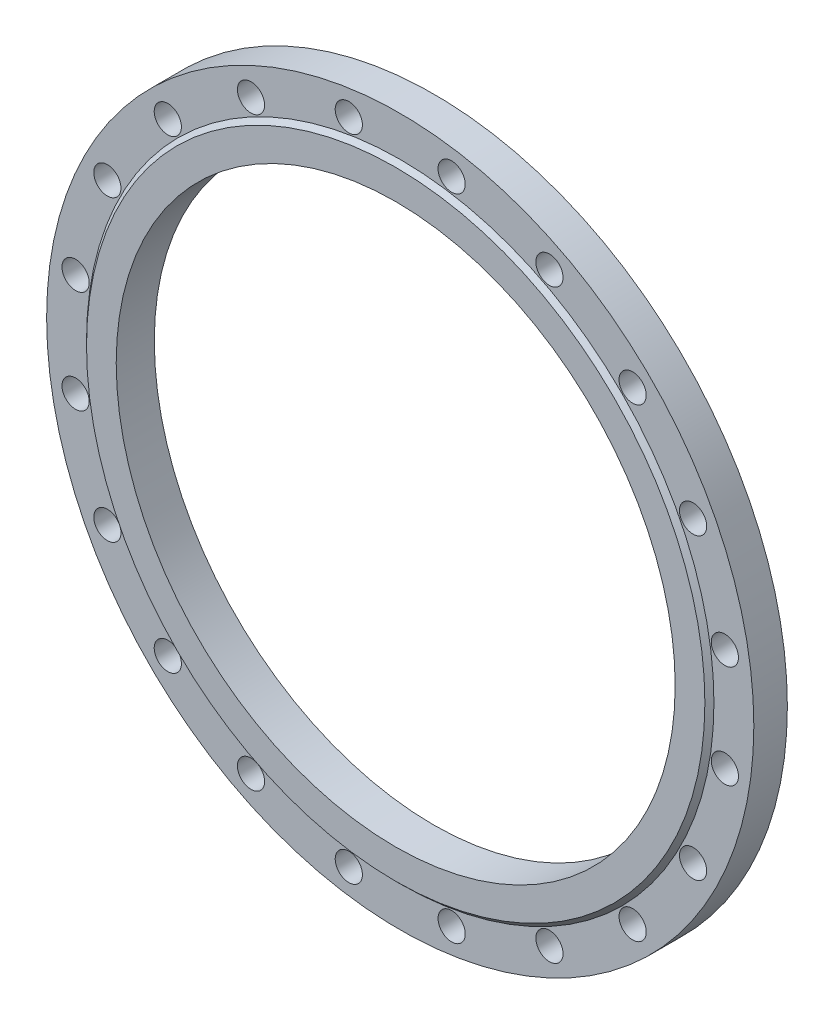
ISO-10303-21;
HEADER;
FILE_DESCRIPTION(('STEP AP214'),'2;1');
FILE_NAME('part.step','',(''),(''),'','','');
FILE_SCHEMA(('AUTOMOTIVE_DESIGN { 1 0 10303 214 1 1 1 1 }'));
ENDSEC;
DATA;
#1=APPLICATION_CONTEXT('core data for automotive mechanical design processes');
#2=APPLICATION_PROTOCOL_DEFINITION('international standard','automotive_design',2000,#1);
#3=PRODUCT_CONTEXT('',#1,'mechanical');
#4=PRODUCT('Part','Part','',(#3));
#5=PRODUCT_RELATED_PRODUCT_CATEGORY('part','',(#4));
#6=PRODUCT_DEFINITION_FORMATION('','',#4);
#7=PRODUCT_DEFINITION_CONTEXT('part definition',#1,'design');
#8=PRODUCT_DEFINITION('design','',#6,#7);
#9=PRODUCT_DEFINITION_SHAPE('','',#8);
#10=(LENGTH_UNIT() NAMED_UNIT(*) SI_UNIT(.MILLI.,.METRE.));
#11=(NAMED_UNIT(*) PLANE_ANGLE_UNIT() SI_UNIT($,.RADIAN.));
#12=(NAMED_UNIT(*) SI_UNIT($,.STERADIAN.) SOLID_ANGLE_UNIT());
#13=UNCERTAINTY_MEASURE_WITH_UNIT(LENGTH_MEASURE(1.E-05),#10,'distance_accuracy_value','');
#14=(GEOMETRIC_REPRESENTATION_CONTEXT(3) GLOBAL_UNCERTAINTY_ASSIGNED_CONTEXT((#13)) GLOBAL_UNIT_ASSIGNED_CONTEXT((#10,
#11,#12)) REPRESENTATION_CONTEXT('',''));
#15=CARTESIAN_POINT('',(0.,0.,0.));
#16=DIRECTION('',(0.,0.,1.));
#17=DIRECTION('',(1.,0.,0.));
#18=AXIS2_PLACEMENT_3D('',#15,#16,#17);
#19=CARTESIAN_POINT('',(0.,390.,-13.));
#20=DIRECTION('',(0.,0.,-1.));
#21=DIRECTION('',(-1.,0.,0.));
#22=AXIS2_PLACEMENT_3D('',#19,#20,#21);
#23=PLANE('',#22);
#24=CARTESIAN_POINT('',(322.989865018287,164.571556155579,-13.));
#25=DIRECTION('',(0.,0.,1.));
#26=DIRECTION('',(1.,0.,0.));
#27=AXIS2_PLACEMENT_3D('',#24,#25,#26);
#28=CIRCLE('',#27,15.0000000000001);
#29=CARTESIAN_POINT('',(337.989865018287,164.571556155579,-13.));
#30=VERTEX_POINT('',#29);
#31=EDGE_CURVE('E166',#30,#30,#28,.T.);
#32=ORIENTED_EDGE('',*,*,#31,.T.);
#33=EDGE_LOOP('',(#32));
#34=FACE_BOUND('',#33,.T.);
#35=CARTESIAN_POINT('',(256.326208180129,256.326208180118,-13.));
#36=DIRECTION('',(0.,0.,1.));
#37=DIRECTION('',(1.,0.,0.));
#38=AXIS2_PLACEMENT_3D('',#35,#36,#37);
#39=CIRCLE('',#38,15.);
#40=CARTESIAN_POINT('',(271.326208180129,256.326208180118,-13.));
#41=VERTEX_POINT('',#40);
#42=EDGE_CURVE('E160',#41,#41,#39,.T.);
#43=ORIENTED_EDGE('',*,*,#42,.T.);
#44=EDGE_LOOP('',(#43));
#45=FACE_BOUND('',#44,.T.);
#46=CARTESIAN_POINT('',(164.571556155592,322.98986501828,-13.));
#47=DIRECTION('',(0.,0.,1.));
#48=DIRECTION('',(1.,0.,0.));
#49=AXIS2_PLACEMENT_3D('',#46,#47,#48);
#50=CIRCLE('',#49,15.);
#51=CARTESIAN_POINT('',(179.571556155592,322.98986501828,-13.));
#52=VERTEX_POINT('',#51);
#53=EDGE_CURVE('E154',#52,#52,#50,.T.);
#54=ORIENTED_EDGE('',*,*,#53,.T.);
#55=EDGE_LOOP('',(#54));
#56=FACE_BOUND('',#55,.T.);
#57=CARTESIAN_POINT('',(56.7074935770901,358.037023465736,-13.));
#58=DIRECTION('',(0.,0.,1.));
#59=DIRECTION('',(1.,0.,0.));
#60=AXIS2_PLACEMENT_3D('',#57,#58,#59);
#61=CIRCLE('',#60,15.);
#62=CARTESIAN_POINT('',(71.7074935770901,358.037023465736,-13.));
#63=VERTEX_POINT('',#62);
#64=EDGE_CURVE('E148',#63,#63,#61,.T.);
#65=ORIENTED_EDGE('',*,*,#64,.T.);
#66=EDGE_LOOP('',(#65));
#67=FACE_BOUND('',#66,.T.);
#68=CARTESIAN_POINT('',(-56.7074935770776,358.037023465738,-13.));
#69=DIRECTION('',(0.,0.,1.));
#70=DIRECTION('',(1.,0.,0.));
#71=AXIS2_PLACEMENT_3D('',#68,#69,#70);
#72=CIRCLE('',#71,15.);
#73=CARTESIAN_POINT('',(-41.7074935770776,358.037023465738,-13.));
#74=VERTEX_POINT('',#73);
#75=EDGE_CURVE('E142',#74,#74,#72,.T.);
#76=ORIENTED_EDGE('',*,*,#75,.T.);
#77=EDGE_LOOP('',(#76));
#78=FACE_BOUND('',#77,.T.);
#79=CARTESIAN_POINT('',(-164.571556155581,322.989865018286,-13.));
#80=DIRECTION('',(0.,0.,1.));
#81=DIRECTION('',(1.,0.,0.));
#82=AXIS2_PLACEMENT_3D('',#79,#80,#81);
#83=CIRCLE('',#82,15.);
#84=CARTESIAN_POINT('',(-149.571556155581,322.989865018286,-13.));
#85=VERTEX_POINT('',#84);
#86=EDGE_CURVE('E136',#85,#85,#83,.T.);
#87=ORIENTED_EDGE('',*,*,#86,.T.);
#88=EDGE_LOOP('',(#87));
#89=FACE_BOUND('',#88,.T.);
#90=CARTESIAN_POINT('',(-256.326208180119,256.326208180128,-13.));
#91=DIRECTION('',(0.,0.,1.));
#92=DIRECTION('',(1.,0.,0.));
#93=AXIS2_PLACEMENT_3D('',#90,#91,#92);
#94=CIRCLE('',#93,15.);
#95=CARTESIAN_POINT('',(-241.326208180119,256.326208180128,-13.));
#96=VERTEX_POINT('',#95);
#97=EDGE_CURVE('E130',#96,#96,#94,.T.);
#98=ORIENTED_EDGE('',*,*,#97,.T.);
#99=EDGE_LOOP('',(#98));
#100=FACE_BOUND('',#99,.T.);
#101=CARTESIAN_POINT('',(-322.989865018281,164.571556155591,-13.));
#102=DIRECTION('',(0.,0.,1.));
#103=DIRECTION('',(1.,0.,0.));
#104=AXIS2_PLACEMENT_3D('',#101,#102,#103);
#105=CIRCLE('',#104,15.);
#106=CARTESIAN_POINT('',(-307.989865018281,164.571556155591,-13.));
#107=VERTEX_POINT('',#106);
#108=EDGE_CURVE('E124',#107,#107,#105,.T.);
#109=ORIENTED_EDGE('',*,*,#108,.T.);
#110=EDGE_LOOP('',(#109));
#111=FACE_BOUND('',#110,.T.);
#112=CARTESIAN_POINT('',(-358.037023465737,56.7074935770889,-13.));
#113=DIRECTION('',(0.,0.,1.));
#114=DIRECTION('',(1.,0.,0.));
#115=AXIS2_PLACEMENT_3D('',#112,#113,#114);
#116=CIRCLE('',#115,15.0000000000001);
#117=CARTESIAN_POINT('',(-343.037023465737,56.7074935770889,-13.));
#118=VERTEX_POINT('',#117);
#119=EDGE_CURVE('E118',#118,#118,#116,.T.);
#120=ORIENTED_EDGE('',*,*,#119,.T.);
#121=EDGE_LOOP('',(#120));
#122=FACE_BOUND('',#121,.T.);
#123=CARTESIAN_POINT('',(-358.037023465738,-56.7074935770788,-13.));
#124=DIRECTION('',(0.,0.,1.));
#125=DIRECTION('',(1.,0.,0.));
#126=AXIS2_PLACEMENT_3D('',#123,#124,#125);
#127=CIRCLE('',#126,15.);
#128=CARTESIAN_POINT('',(-343.037023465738,-56.7074935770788,-13.));
#129=VERTEX_POINT('',#128);
#130=EDGE_CURVE('E112',#129,#129,#127,.T.);
#131=ORIENTED_EDGE('',*,*,#130,.T.);
#132=EDGE_LOOP('',(#131));
#133=FACE_BOUND('',#132,.T.);
#134=CARTESIAN_POINT('',(-322.989865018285,-164.571556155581,-13.));
#135=DIRECTION('',(0.,0.,1.));
#136=DIRECTION('',(1.,0.,0.));
#137=AXIS2_PLACEMENT_3D('',#134,#135,#136);
#138=CIRCLE('',#137,15.);
#139=CARTESIAN_POINT('',(-307.989865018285,-164.571556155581,-13.));
#140=VERTEX_POINT('',#139);
#141=EDGE_CURVE('E106',#140,#140,#138,.T.);
#142=ORIENTED_EDGE('',*,*,#141,.T.);
#143=EDGE_LOOP('',(#142));
#144=FACE_BOUND('',#143,.T.);
#145=CARTESIAN_POINT('',(-256.326208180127,-256.32620818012,-13.));
#146=DIRECTION('',(0.,0.,1.));
#147=DIRECTION('',(1.,0.,0.));
#148=AXIS2_PLACEMENT_3D('',#145,#146,#147);
#149=CIRCLE('',#148,15.);
#150=CARTESIAN_POINT('',(-241.326208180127,-256.32620818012,-13.));
#151=VERTEX_POINT('',#150);
#152=EDGE_CURVE('E100',#151,#151,#149,.T.);
#153=ORIENTED_EDGE('',*,*,#152,.T.);
#154=EDGE_LOOP('',(#153));
#155=FACE_BOUND('',#154,.T.);
#156=CARTESIAN_POINT('',(-164.571556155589,-322.989865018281,-13.));
#157=DIRECTION('',(0.,0.,1.));
#158=DIRECTION('',(1.,0.,0.));
#159=AXIS2_PLACEMENT_3D('',#156,#157,#158);
#160=CIRCLE('',#159,15.);
#161=CARTESIAN_POINT('',(-149.571556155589,-322.989865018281,-13.));
#162=VERTEX_POINT('',#161);
#163=EDGE_CURVE('E94',#162,#162,#160,.T.);
#164=ORIENTED_EDGE('',*,*,#163,.T.);
#165=EDGE_LOOP('',(#164));
#166=FACE_BOUND('',#165,.T.);
#167=CARTESIAN_POINT('',(-56.7074935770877,-358.037023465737,-13.));
#168=DIRECTION('',(0.,0.,1.));
#169=DIRECTION('',(1.,0.,0.));
#170=AXIS2_PLACEMENT_3D('',#167,#168,#169);
#171=CIRCLE('',#170,15.);
#172=CARTESIAN_POINT('',(-41.7074935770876,-358.037023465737,-13.));
#173=VERTEX_POINT('',#172);
#174=EDGE_CURVE('E88',#173,#173,#171,.T.);
#175=ORIENTED_EDGE('',*,*,#174,.T.);
#176=EDGE_LOOP('',(#175));
#177=FACE_BOUND('',#176,.T.);
#178=CARTESIAN_POINT('',(56.7074935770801,-358.037023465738,-13.));
#179=DIRECTION('',(0.,0.,1.));
#180=DIRECTION('',(1.,0.,0.));
#181=AXIS2_PLACEMENT_3D('',#178,#179,#180);
#182=CIRCLE('',#181,15.);
#183=CARTESIAN_POINT('',(71.7074935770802,-358.037023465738,-13.));
#184=VERTEX_POINT('',#183);
#185=EDGE_CURVE('E82',#184,#184,#182,.T.);
#186=ORIENTED_EDGE('',*,*,#185,.T.);
#187=EDGE_LOOP('',(#186));
#188=FACE_BOUND('',#187,.T.);
#189=CARTESIAN_POINT('',(164.571556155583,-322.989865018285,-13.));
#190=DIRECTION('',(0.,0.,1.));
#191=DIRECTION('',(1.,0.,0.));
#192=AXIS2_PLACEMENT_3D('',#189,#190,#191);
#193=CIRCLE('',#192,15.);
#194=CARTESIAN_POINT('',(179.571556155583,-322.989865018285,-13.));
#195=VERTEX_POINT('',#194);
#196=EDGE_CURVE('E76',#195,#195,#193,.T.);
#197=ORIENTED_EDGE('',*,*,#196,.T.);
#198=EDGE_LOOP('',(#197));
#199=FACE_BOUND('',#198,.T.);
#200=CARTESIAN_POINT('',(256.326208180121,-256.326208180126,-13.));
#201=DIRECTION('',(0.,0.,1.));
#202=DIRECTION('',(1.,0.,0.));
#203=AXIS2_PLACEMENT_3D('',#200,#201,#202);
#204=CIRCLE('',#203,15.0000000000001);
#205=CARTESIAN_POINT('',(271.326208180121,-256.326208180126,-13.));
#206=VERTEX_POINT('',#205);
#207=EDGE_CURVE('E70',#206,#206,#204,.T.);
#208=ORIENTED_EDGE('',*,*,#207,.T.);
#209=EDGE_LOOP('',(#208));
#210=FACE_BOUND('',#209,.T.);
#211=CARTESIAN_POINT('',(322.989865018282,-164.571556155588,-13.));
#212=DIRECTION('',(0.,0.,1.));
#213=DIRECTION('',(1.,0.,0.));
#214=AXIS2_PLACEMENT_3D('',#211,#212,#213);
#215=CIRCLE('',#214,15.);
#216=CARTESIAN_POINT('',(337.989865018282,-164.571556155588,-13.));
#217=VERTEX_POINT('',#216);
#218=EDGE_CURVE('E64',#217,#217,#215,.T.);
#219=ORIENTED_EDGE('',*,*,#218,.T.);
#220=EDGE_LOOP('',(#219));
#221=FACE_BOUND('',#220,.T.);
#222=CARTESIAN_POINT('',(358.037023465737,-56.7074935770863,-13.));
#223=DIRECTION('',(0.,0.,1.));
#224=DIRECTION('',(1.,0.,0.));
#225=AXIS2_PLACEMENT_3D('',#222,#223,#224);
#226=CIRCLE('',#225,15.);
#227=CARTESIAN_POINT('',(373.037023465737,-56.7074935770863,-13.));
#228=VERTEX_POINT('',#227);
#229=EDGE_CURVE('E58',#228,#228,#226,.T.);
#230=ORIENTED_EDGE('',*,*,#229,.T.);
#231=EDGE_LOOP('',(#230));
#232=FACE_BOUND('',#231,.T.);
#233=CARTESIAN_POINT('',(358.037023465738,56.7074935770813,-13.));
#234=DIRECTION('',(0.,0.,1.));
#235=DIRECTION('',(1.,0.,0.));
#236=AXIS2_PLACEMENT_3D('',#233,#234,#235);
#237=CIRCLE('',#236,15.);
#238=CARTESIAN_POINT('',(373.037023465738,56.7074935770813,-13.));
#239=VERTEX_POINT('',#238);
#240=EDGE_CURVE('E54',#239,#239,#237,.T.);
#241=ORIENTED_EDGE('',*,*,#240,.T.);
#242=EDGE_LOOP('',(#241));
#243=FACE_BOUND('',#242,.T.);
#244=CARTESIAN_POINT('',(0.,0.,-13.));
#245=DIRECTION('',(0.,0.,-1.));
#246=DIRECTION('',(-1.,0.,0.));
#247=AXIS2_PLACEMENT_3D('',#244,#245,#246);
#248=CIRCLE('',#247,390.);
#249=CARTESIAN_POINT('',(-390.,0.,-13.));
#250=VERTEX_POINT('',#249);
#251=EDGE_CURVE('E10',#250,#250,#248,.T.);
#252=ORIENTED_EDGE('',*,*,#251,.T.);
#253=EDGE_LOOP('',(#252));
#254=FACE_BOUND('',#253,.T.);
#255=CARTESIAN_POINT('',(0.,0.,-13.));
#256=DIRECTION('',(0.,0.,-1.));
#257=DIRECTION('',(-1.,0.,0.));
#258=AXIS2_PLACEMENT_3D('',#255,#256,#257);
#259=CIRCLE('',#258,308.25);
#260=CARTESIAN_POINT('',(-308.25,0.,-13.));
#261=VERTEX_POINT('',#260);
#262=EDGE_CURVE('E51',#261,#261,#259,.T.);
#263=ORIENTED_EDGE('',*,*,#262,.F.);
#264=EDGE_LOOP('',(#263));
#265=FACE_BOUND('',#264,.T.);
#266=ADVANCED_FACE('F29',(#34,#45,#56,#67,#78,#89,#100,#111,#122,#133,#144,#155,#166,#177,#188,
#199,#210,#221,#232,#243,#254,#265),#23,.T.);
#267=CARTESIAN_POINT('',(0.,0.,0.));
#268=DIRECTION('',(0.,0.,-1.));
#269=DIRECTION('',(-1.,0.,0.));
#270=AXIS2_PLACEMENT_3D('',#267,#268,#269);
#271=CYLINDRICAL_SURFACE('',#270,390.);
#272=CARTESIAN_POINT('',(0.,0.,24.));
#273=DIRECTION('',(0.,0.,-1.));
#274=DIRECTION('',(-1.,0.,0.));
#275=AXIS2_PLACEMENT_3D('',#272,#273,#274);
#276=CIRCLE('',#275,390.);
#277=CARTESIAN_POINT('',(-390.,0.,24.));
#278=VERTEX_POINT('',#277);
#279=EDGE_CURVE('E35',#278,#278,#276,.T.);
#280=ORIENTED_EDGE('',*,*,#279,.T.);
#281=EDGE_LOOP('',(#280));
#282=FACE_BOUND('',#281,.T.);
#283=ORIENTED_EDGE('',*,*,#251,.F.);
#284=EDGE_LOOP('',(#283));
#285=FACE_BOUND('',#284,.T.);
#286=ADVANCED_FACE('F188',(#282,#285),#271,.T.);
#287=CARTESIAN_POINT('',(0.,346.,24.));
#288=DIRECTION('',(0.,0.,1.));
#289=DIRECTION('',(1.,0.,0.));
#290=AXIS2_PLACEMENT_3D('',#287,#288,#289);
#291=PLANE('',#290);
#292=CARTESIAN_POINT('',(322.989865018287,164.571556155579,24.));
#293=DIRECTION('',(0.,0.,1.));
#294=DIRECTION('',(1.,0.,0.));
#295=AXIS2_PLACEMENT_3D('',#292,#293,#294);
#296=CIRCLE('',#295,15.0000000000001);
#297=CARTESIAN_POINT('',(337.989865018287,164.571556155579,24.));
#298=VERTEX_POINT('',#297);
#299=EDGE_CURVE('E169',#298,#298,#296,.T.);
#300=ORIENTED_EDGE('',*,*,#299,.F.);
#301=EDGE_LOOP('',(#300));
#302=FACE_BOUND('',#301,.T.);
#303=CARTESIAN_POINT('',(256.326208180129,256.326208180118,24.));
#304=DIRECTION('',(0.,0.,1.));
#305=DIRECTION('',(1.,0.,0.));
#306=AXIS2_PLACEMENT_3D('',#303,#304,#305);
#307=CIRCLE('',#306,15.);
#308=CARTESIAN_POINT('',(271.326208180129,256.326208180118,24.));
#309=VERTEX_POINT('',#308);
#310=EDGE_CURVE('E163',#309,#309,#307,.T.);
#311=ORIENTED_EDGE('',*,*,#310,.F.);
#312=EDGE_LOOP('',(#311));
#313=FACE_BOUND('',#312,.T.);
#314=CARTESIAN_POINT('',(164.571556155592,322.98986501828,24.));
#315=DIRECTION('',(0.,0.,1.));
#316=DIRECTION('',(1.,0.,0.));
#317=AXIS2_PLACEMENT_3D('',#314,#315,#316);
#318=CIRCLE('',#317,15.);
#319=CARTESIAN_POINT('',(179.571556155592,322.98986501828,24.));
#320=VERTEX_POINT('',#319);
#321=EDGE_CURVE('E157',#320,#320,#318,.T.);
#322=ORIENTED_EDGE('',*,*,#321,.F.);
#323=EDGE_LOOP('',(#322));
#324=FACE_BOUND('',#323,.T.);
#325=CARTESIAN_POINT('',(56.7074935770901,358.037023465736,24.));
#326=DIRECTION('',(0.,0.,1.));
#327=DIRECTION('',(1.,0.,0.));
#328=AXIS2_PLACEMENT_3D('',#325,#326,#327);
#329=CIRCLE('',#328,15.);
#330=CARTESIAN_POINT('',(71.7074935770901,358.037023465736,24.));
#331=VERTEX_POINT('',#330);
#332=EDGE_CURVE('E151',#331,#331,#329,.T.);
#333=ORIENTED_EDGE('',*,*,#332,.F.);
#334=EDGE_LOOP('',(#333));
#335=FACE_BOUND('',#334,.T.);
#336=CARTESIAN_POINT('',(-56.7074935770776,358.037023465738,24.));
#337=DIRECTION('',(0.,0.,1.));
#338=DIRECTION('',(1.,0.,0.));
#339=AXIS2_PLACEMENT_3D('',#336,#337,#338);
#340=CIRCLE('',#339,15.);
#341=CARTESIAN_POINT('',(-41.7074935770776,358.037023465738,24.));
#342=VERTEX_POINT('',#341);
#343=EDGE_CURVE('E145',#342,#342,#340,.T.);
#344=ORIENTED_EDGE('',*,*,#343,.F.);
#345=EDGE_LOOP('',(#344));
#346=FACE_BOUND('',#345,.T.);
#347=CARTESIAN_POINT('',(-164.571556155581,322.989865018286,24.));
#348=DIRECTION('',(0.,0.,1.));
#349=DIRECTION('',(1.,0.,0.));
#350=AXIS2_PLACEMENT_3D('',#347,#348,#349);
#351=CIRCLE('',#350,15.);
#352=CARTESIAN_POINT('',(-149.571556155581,322.989865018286,24.));
#353=VERTEX_POINT('',#352);
#354=EDGE_CURVE('E139',#353,#353,#351,.T.);
#355=ORIENTED_EDGE('',*,*,#354,.F.);
#356=EDGE_LOOP('',(#355));
#357=FACE_BOUND('',#356,.T.);
#358=CARTESIAN_POINT('',(-256.326208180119,256.326208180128,24.));
#359=DIRECTION('',(0.,0.,1.));
#360=DIRECTION('',(1.,0.,0.));
#361=AXIS2_PLACEMENT_3D('',#358,#359,#360);
#362=CIRCLE('',#361,15.);
#363=CARTESIAN_POINT('',(-241.326208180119,256.326208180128,24.));
#364=VERTEX_POINT('',#363);
#365=EDGE_CURVE('E133',#364,#364,#362,.T.);
#366=ORIENTED_EDGE('',*,*,#365,.F.);
#367=EDGE_LOOP('',(#366));
#368=FACE_BOUND('',#367,.T.);
#369=CARTESIAN_POINT('',(-322.989865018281,164.571556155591,24.));
#370=DIRECTION('',(0.,0.,1.));
#371=DIRECTION('',(1.,0.,0.));
#372=AXIS2_PLACEMENT_3D('',#369,#370,#371);
#373=CIRCLE('',#372,15.);
#374=CARTESIAN_POINT('',(-307.989865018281,164.571556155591,24.));
#375=VERTEX_POINT('',#374);
#376=EDGE_CURVE('E127',#375,#375,#373,.T.);
#377=ORIENTED_EDGE('',*,*,#376,.F.);
#378=EDGE_LOOP('',(#377));
#379=FACE_BOUND('',#378,.T.);
#380=CARTESIAN_POINT('',(-358.037023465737,56.7074935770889,24.));
#381=DIRECTION('',(0.,0.,1.));
#382=DIRECTION('',(1.,0.,0.));
#383=AXIS2_PLACEMENT_3D('',#380,#381,#382);
#384=CIRCLE('',#383,15.0000000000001);
#385=CARTESIAN_POINT('',(-343.037023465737,56.7074935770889,24.));
#386=VERTEX_POINT('',#385);
#387=EDGE_CURVE('E121',#386,#386,#384,.T.);
#388=ORIENTED_EDGE('',*,*,#387,.F.);
#389=EDGE_LOOP('',(#388));
#390=FACE_BOUND('',#389,.T.);
#391=CARTESIAN_POINT('',(-358.037023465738,-56.7074935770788,24.));
#392=DIRECTION('',(0.,0.,1.));
#393=DIRECTION('',(1.,0.,0.));
#394=AXIS2_PLACEMENT_3D('',#391,#392,#393);
#395=CIRCLE('',#394,15.);
#396=CARTESIAN_POINT('',(-343.037023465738,-56.7074935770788,24.));
#397=VERTEX_POINT('',#396);
#398=EDGE_CURVE('E115',#397,#397,#395,.T.);
#399=ORIENTED_EDGE('',*,*,#398,.F.);
#400=EDGE_LOOP('',(#399));
#401=FACE_BOUND('',#400,.T.);
#402=CARTESIAN_POINT('',(-322.989865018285,-164.571556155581,24.));
#403=DIRECTION('',(0.,0.,1.));
#404=DIRECTION('',(1.,0.,0.));
#405=AXIS2_PLACEMENT_3D('',#402,#403,#404);
#406=CIRCLE('',#405,15.);
#407=CARTESIAN_POINT('',(-307.989865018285,-164.571556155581,24.));
#408=VERTEX_POINT('',#407);
#409=EDGE_CURVE('E109',#408,#408,#406,.T.);
#410=ORIENTED_EDGE('',*,*,#409,.F.);
#411=EDGE_LOOP('',(#410));
#412=FACE_BOUND('',#411,.T.);
#413=CARTESIAN_POINT('',(-256.326208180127,-256.32620818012,24.));
#414=DIRECTION('',(0.,0.,1.));
#415=DIRECTION('',(1.,0.,0.));
#416=AXIS2_PLACEMENT_3D('',#413,#414,#415);
#417=CIRCLE('',#416,15.);
#418=CARTESIAN_POINT('',(-241.326208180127,-256.32620818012,24.));
#419=VERTEX_POINT('',#418);
#420=EDGE_CURVE('E103',#419,#419,#417,.T.);
#421=ORIENTED_EDGE('',*,*,#420,.F.);
#422=EDGE_LOOP('',(#421));
#423=FACE_BOUND('',#422,.T.);
#424=CARTESIAN_POINT('',(-164.571556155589,-322.989865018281,24.));
#425=DIRECTION('',(0.,0.,1.));
#426=DIRECTION('',(1.,0.,0.));
#427=AXIS2_PLACEMENT_3D('',#424,#425,#426);
#428=CIRCLE('',#427,15.);
#429=CARTESIAN_POINT('',(-149.571556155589,-322.989865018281,24.));
#430=VERTEX_POINT('',#429);
#431=EDGE_CURVE('E97',#430,#430,#428,.T.);
#432=ORIENTED_EDGE('',*,*,#431,.F.);
#433=EDGE_LOOP('',(#432));
#434=FACE_BOUND('',#433,.T.);
#435=CARTESIAN_POINT('',(-56.7074935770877,-358.037023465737,24.));
#436=DIRECTION('',(0.,0.,1.));
#437=DIRECTION('',(1.,0.,0.));
#438=AXIS2_PLACEMENT_3D('',#435,#436,#437);
#439=CIRCLE('',#438,15.);
#440=CARTESIAN_POINT('',(-41.7074935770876,-358.037023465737,24.));
#441=VERTEX_POINT('',#440);
#442=EDGE_CURVE('E91',#441,#441,#439,.T.);
#443=ORIENTED_EDGE('',*,*,#442,.F.);
#444=EDGE_LOOP('',(#443));
#445=FACE_BOUND('',#444,.T.);
#446=CARTESIAN_POINT('',(56.7074935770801,-358.037023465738,24.));
#447=DIRECTION('',(0.,0.,1.));
#448=DIRECTION('',(1.,0.,0.));
#449=AXIS2_PLACEMENT_3D('',#446,#447,#448);
#450=CIRCLE('',#449,15.);
#451=CARTESIAN_POINT('',(71.7074935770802,-358.037023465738,24.));
#452=VERTEX_POINT('',#451);
#453=EDGE_CURVE('E85',#452,#452,#450,.T.);
#454=ORIENTED_EDGE('',*,*,#453,.F.);
#455=EDGE_LOOP('',(#454));
#456=FACE_BOUND('',#455,.T.);
#457=CARTESIAN_POINT('',(164.571556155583,-322.989865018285,24.));
#458=DIRECTION('',(0.,0.,1.));
#459=DIRECTION('',(1.,0.,0.));
#460=AXIS2_PLACEMENT_3D('',#457,#458,#459);
#461=CIRCLE('',#460,15.);
#462=CARTESIAN_POINT('',(179.571556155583,-322.989865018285,24.));
#463=VERTEX_POINT('',#462);
#464=EDGE_CURVE('E79',#463,#463,#461,.T.);
#465=ORIENTED_EDGE('',*,*,#464,.F.);
#466=EDGE_LOOP('',(#465));
#467=FACE_BOUND('',#466,.T.);
#468=CARTESIAN_POINT('',(256.326208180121,-256.326208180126,24.));
#469=DIRECTION('',(0.,0.,1.));
#470=DIRECTION('',(1.,0.,0.));
#471=AXIS2_PLACEMENT_3D('',#468,#469,#470);
#472=CIRCLE('',#471,15.0000000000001);
#473=CARTESIAN_POINT('',(271.326208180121,-256.326208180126,24.));
#474=VERTEX_POINT('',#473);
#475=EDGE_CURVE('E73',#474,#474,#472,.T.);
#476=ORIENTED_EDGE('',*,*,#475,.F.);
#477=EDGE_LOOP('',(#476));
#478=FACE_BOUND('',#477,.T.);
#479=CARTESIAN_POINT('',(322.989865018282,-164.571556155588,24.));
#480=DIRECTION('',(0.,0.,1.));
#481=DIRECTION('',(1.,0.,0.));
#482=AXIS2_PLACEMENT_3D('',#479,#480,#481);
#483=CIRCLE('',#482,15.);
#484=CARTESIAN_POINT('',(337.989865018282,-164.571556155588,24.));
#485=VERTEX_POINT('',#484);
#486=EDGE_CURVE('E67',#485,#485,#483,.T.);
#487=ORIENTED_EDGE('',*,*,#486,.F.);
#488=EDGE_LOOP('',(#487));
#489=FACE_BOUND('',#488,.T.);
#490=CARTESIAN_POINT('',(358.037023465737,-56.7074935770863,24.));
#491=DIRECTION('',(0.,0.,1.));
#492=DIRECTION('',(1.,0.,0.));
#493=AXIS2_PLACEMENT_3D('',#490,#491,#492);
#494=CIRCLE('',#493,15.);
#495=CARTESIAN_POINT('',(373.037023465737,-56.7074935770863,24.));
#496=VERTEX_POINT('',#495);
#497=EDGE_CURVE('E61',#496,#496,#494,.T.);
#498=ORIENTED_EDGE('',*,*,#497,.F.);
#499=EDGE_LOOP('',(#498));
#500=FACE_BOUND('',#499,.T.);
#501=CARTESIAN_POINT('',(358.037023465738,56.7074935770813,24.));
#502=DIRECTION('',(0.,0.,1.));
#503=DIRECTION('',(1.,0.,0.));
#504=AXIS2_PLACEMENT_3D('',#501,#502,#503);
#505=CIRCLE('',#504,15.);
#506=CARTESIAN_POINT('',(373.037023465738,56.7074935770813,24.));
#507=VERTEX_POINT('',#506);
#508=EDGE_CURVE('E55',#507,#507,#505,.T.);
#509=ORIENTED_EDGE('',*,*,#508,.F.);
#510=EDGE_LOOP('',(#509));
#511=FACE_BOUND('',#510,.T.);
#512=CARTESIAN_POINT('',(0.,0.,24.));
#513=DIRECTION('',(0.,0.,-1.));
#514=DIRECTION('',(-1.,0.,0.));
#515=AXIS2_PLACEMENT_3D('',#512,#513,#514);
#516=CIRCLE('',#515,346.);
#517=CARTESIAN_POINT('',(-346.,0.,24.));
#518=VERTEX_POINT('',#517);
#519=EDGE_CURVE('E39',#518,#518,#516,.T.);
#520=ORIENTED_EDGE('',*,*,#519,.T.);
#521=EDGE_LOOP('',(#520));
#522=FACE_BOUND('',#521,.T.);
#523=ORIENTED_EDGE('',*,*,#279,.F.);
#524=EDGE_LOOP('',(#523));
#525=FACE_BOUND('',#524,.T.);
#526=ADVANCED_FACE('F184',(#302,#313,#324,#335,#346,#357,#368,#379,#390,#401,#412,#423,#434,
#445,#456,#467,#478,#489,#500,#511,#522,#525),#291,.T.);
#527=CARTESIAN_POINT('',(0.,0.,24.));
#528=DIRECTION('',(0.,0.,-1.));
#529=DIRECTION('',(-1.,0.,0.));
#530=AXIS2_PLACEMENT_3D('',#527,#528,#529);
#531=CONICAL_SURFACE('',#530,346.,0.785398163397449);
#532=CARTESIAN_POINT('',(0.,0.,29.));
#533=DIRECTION('',(0.,0.,-1.));
#534=DIRECTION('',(-1.,0.,0.));
#535=AXIS2_PLACEMENT_3D('',#532,#533,#534);
#536=CIRCLE('',#535,341.);
#537=CARTESIAN_POINT('',(-341.,0.,29.));
#538=VERTEX_POINT('',#537);
#539=EDGE_CURVE('E43',#538,#538,#536,.T.);
#540=ORIENTED_EDGE('',*,*,#539,.T.);
#541=EDGE_LOOP('',(#540));
#542=FACE_BOUND('',#541,.T.);
#543=ORIENTED_EDGE('',*,*,#519,.F.);
#544=EDGE_LOOP('',(#543));
#545=FACE_BOUND('',#544,.T.);
#546=ADVANCED_FACE('F187',(#542,#545),#531,.T.);
#547=CARTESIAN_POINT('',(0.,341.,29.));
#548=DIRECTION('',(0.,0.,1.));
#549=DIRECTION('',(1.,0.,0.));
#550=AXIS2_PLACEMENT_3D('',#547,#548,#549);
#551=PLANE('',#550);
#552=CARTESIAN_POINT('',(0.,0.,29.));
#553=DIRECTION('',(0.,0.,-1.));
#554=DIRECTION('',(-1.,0.,0.));
#555=AXIS2_PLACEMENT_3D('',#552,#553,#554);
#556=CIRCLE('',#555,308.25);
#557=CARTESIAN_POINT('',(-308.25,0.,29.));
#558=VERTEX_POINT('',#557);
#559=EDGE_CURVE('E48',#558,#558,#556,.T.);
#560=ORIENTED_EDGE('',*,*,#559,.T.);
#561=EDGE_LOOP('',(#560));
#562=FACE_BOUND('',#561,.T.);
#563=ORIENTED_EDGE('',*,*,#539,.F.);
#564=EDGE_LOOP('',(#563));
#565=FACE_BOUND('',#564,.T.);
#566=ADVANCED_FACE('F232',(#562,#565),#551,.T.);
#567=CARTESIAN_POINT('',(0.,0.,0.));
#568=DIRECTION('',(0.,0.,-1.));
#569=DIRECTION('',(-1.,0.,0.));
#570=AXIS2_PLACEMENT_3D('',#567,#568,#569);
#571=CYLINDRICAL_SURFACE('',#570,308.25);
#572=ORIENTED_EDGE('',*,*,#262,.T.);
#573=EDGE_LOOP('',(#572));
#574=FACE_BOUND('',#573,.T.);
#575=ORIENTED_EDGE('',*,*,#559,.F.);
#576=EDGE_LOOP('',(#575));
#577=FACE_BOUND('',#576,.T.);
#578=ADVANCED_FACE('F238',(#574,#577),#571,.F.);
#579=CARTESIAN_POINT('',(358.037023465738,56.7074935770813,-13.));
#580=DIRECTION('',(0.,0.,1.));
#581=DIRECTION('',(1.,0.,0.));
#582=AXIS2_PLACEMENT_3D('',#579,#580,#581);
#583=CYLINDRICAL_SURFACE('',#582,15.);
#584=ORIENTED_EDGE('',*,*,#240,.F.);
#585=EDGE_LOOP('',(#584));
#586=FACE_BOUND('',#585,.T.);
#587=ORIENTED_EDGE('',*,*,#508,.T.);
#588=EDGE_LOOP('',(#587));
#589=FACE_BOUND('',#588,.T.);
#590=ADVANCED_FACE('F261',(#586,#589),#583,.F.);
#591=CARTESIAN_POINT('',(358.037023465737,-56.7074935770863,-13.));
#592=DIRECTION('',(0.,0.,1.));
#593=DIRECTION('',(1.,0.,0.));
#594=AXIS2_PLACEMENT_3D('',#591,#592,#593);
#595=CYLINDRICAL_SURFACE('',#594,15.);
#596=ORIENTED_EDGE('',*,*,#229,.F.);
#597=EDGE_LOOP('',(#596));
#598=FACE_BOUND('',#597,.T.);
#599=ORIENTED_EDGE('',*,*,#497,.T.);
#600=EDGE_LOOP('',(#599));
#601=FACE_BOUND('',#600,.T.);
#602=ADVANCED_FACE('F266',(#598,#601),#595,.F.);
#603=CARTESIAN_POINT('',(322.989865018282,-164.571556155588,-13.));
#604=DIRECTION('',(0.,0.,1.));
#605=DIRECTION('',(1.,0.,0.));
#606=AXIS2_PLACEMENT_3D('',#603,#604,#605);
#607=CYLINDRICAL_SURFACE('',#606,15.);
#608=ORIENTED_EDGE('',*,*,#218,.F.);
#609=EDGE_LOOP('',(#608));
#610=FACE_BOUND('',#609,.T.);
#611=ORIENTED_EDGE('',*,*,#486,.T.);
#612=EDGE_LOOP('',(#611));
#613=FACE_BOUND('',#612,.T.);
#614=ADVANCED_FACE('F278',(#610,#613),#607,.F.);
#615=CARTESIAN_POINT('',(256.326208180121,-256.326208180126,-13.));
#616=DIRECTION('',(0.,0.,1.));
#617=DIRECTION('',(1.,0.,0.));
#618=AXIS2_PLACEMENT_3D('',#615,#616,#617);
#619=CYLINDRICAL_SURFACE('',#618,15.0000000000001);
#620=ORIENTED_EDGE('',*,*,#207,.F.);
#621=EDGE_LOOP('',(#620));
#622=FACE_BOUND('',#621,.T.);
#623=ORIENTED_EDGE('',*,*,#475,.T.);
#624=EDGE_LOOP('',(#623));
#625=FACE_BOUND('',#624,.T.);
#626=ADVANCED_FACE('F288',(#622,#625),#619,.F.);
#627=CARTESIAN_POINT('',(164.571556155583,-322.989865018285,-13.));
#628=DIRECTION('',(0.,0.,1.));
#629=DIRECTION('',(1.,0.,0.));
#630=AXIS2_PLACEMENT_3D('',#627,#628,#629);
#631=CYLINDRICAL_SURFACE('',#630,15.);
#632=ORIENTED_EDGE('',*,*,#196,.F.);
#633=EDGE_LOOP('',(#632));
#634=FACE_BOUND('',#633,.T.);
#635=ORIENTED_EDGE('',*,*,#464,.T.);
#636=EDGE_LOOP('',(#635));
#637=FACE_BOUND('',#636,.T.);
#638=ADVANCED_FACE('F298',(#634,#637),#631,.F.);
#639=CARTESIAN_POINT('',(56.7074935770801,-358.037023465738,-13.));
#640=DIRECTION('',(0.,0.,1.));
#641=DIRECTION('',(1.,0.,0.));
#642=AXIS2_PLACEMENT_3D('',#639,#640,#641);
#643=CYLINDRICAL_SURFACE('',#642,15.);
#644=ORIENTED_EDGE('',*,*,#185,.F.);
#645=EDGE_LOOP('',(#644));
#646=FACE_BOUND('',#645,.T.);
#647=ORIENTED_EDGE('',*,*,#453,.T.);
#648=EDGE_LOOP('',(#647));
#649=FACE_BOUND('',#648,.T.);
#650=ADVANCED_FACE('F308',(#646,#649),#643,.F.);
#651=CARTESIAN_POINT('',(-56.7074935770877,-358.037023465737,-13.));
#652=DIRECTION('',(0.,0.,1.));
#653=DIRECTION('',(1.,0.,0.));
#654=AXIS2_PLACEMENT_3D('',#651,#652,#653);
#655=CYLINDRICAL_SURFACE('',#654,15.);
#656=ORIENTED_EDGE('',*,*,#174,.F.);
#657=EDGE_LOOP('',(#656));
#658=FACE_BOUND('',#657,.T.);
#659=ORIENTED_EDGE('',*,*,#442,.T.);
#660=EDGE_LOOP('',(#659));
#661=FACE_BOUND('',#660,.T.);
#662=ADVANCED_FACE('F318',(#658,#661),#655,.F.);
#663=CARTESIAN_POINT('',(-164.571556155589,-322.989865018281,-13.));
#664=DIRECTION('',(0.,0.,1.));
#665=DIRECTION('',(1.,0.,0.));
#666=AXIS2_PLACEMENT_3D('',#663,#664,#665);
#667=CYLINDRICAL_SURFACE('',#666,15.);
#668=ORIENTED_EDGE('',*,*,#163,.F.);
#669=EDGE_LOOP('',(#668));
#670=FACE_BOUND('',#669,.T.);
#671=ORIENTED_EDGE('',*,*,#431,.T.);
#672=EDGE_LOOP('',(#671));
#673=FACE_BOUND('',#672,.T.);
#674=ADVANCED_FACE('F328',(#670,#673),#667,.F.);
#675=CARTESIAN_POINT('',(-256.326208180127,-256.32620818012,-13.));
#676=DIRECTION('',(0.,0.,1.));
#677=DIRECTION('',(1.,0.,0.));
#678=AXIS2_PLACEMENT_3D('',#675,#676,#677);
#679=CYLINDRICAL_SURFACE('',#678,15.);
#680=ORIENTED_EDGE('',*,*,#152,.F.);
#681=EDGE_LOOP('',(#680));
#682=FACE_BOUND('',#681,.T.);
#683=ORIENTED_EDGE('',*,*,#420,.T.);
#684=EDGE_LOOP('',(#683));
#685=FACE_BOUND('',#684,.T.);
#686=ADVANCED_FACE('F338',(#682,#685),#679,.F.);
#687=CARTESIAN_POINT('',(-322.989865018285,-164.571556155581,-13.));
#688=DIRECTION('',(0.,0.,1.));
#689=DIRECTION('',(1.,0.,0.));
#690=AXIS2_PLACEMENT_3D('',#687,#688,#689);
#691=CYLINDRICAL_SURFACE('',#690,15.);
#692=ORIENTED_EDGE('',*,*,#141,.F.);
#693=EDGE_LOOP('',(#692));
#694=FACE_BOUND('',#693,.T.);
#695=ORIENTED_EDGE('',*,*,#409,.T.);
#696=EDGE_LOOP('',(#695));
#697=FACE_BOUND('',#696,.T.);
#698=ADVANCED_FACE('F348',(#694,#697),#691,.F.);
#699=CARTESIAN_POINT('',(-358.037023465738,-56.7074935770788,-13.));
#700=DIRECTION('',(0.,0.,1.));
#701=DIRECTION('',(1.,0.,0.));
#702=AXIS2_PLACEMENT_3D('',#699,#700,#701);
#703=CYLINDRICAL_SURFACE('',#702,15.);
#704=ORIENTED_EDGE('',*,*,#130,.F.);
#705=EDGE_LOOP('',(#704));
#706=FACE_BOUND('',#705,.T.);
#707=ORIENTED_EDGE('',*,*,#398,.T.);
#708=EDGE_LOOP('',(#707));
#709=FACE_BOUND('',#708,.T.);
#710=ADVANCED_FACE('F358',(#706,#709),#703,.F.);
#711=CARTESIAN_POINT('',(-358.037023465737,56.7074935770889,-13.));
#712=DIRECTION('',(0.,0.,1.));
#713=DIRECTION('',(1.,0.,0.));
#714=AXIS2_PLACEMENT_3D('',#711,#712,#713);
#715=CYLINDRICAL_SURFACE('',#714,15.0000000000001);
#716=ORIENTED_EDGE('',*,*,#119,.F.);
#717=EDGE_LOOP('',(#716));
#718=FACE_BOUND('',#717,.T.);
#719=ORIENTED_EDGE('',*,*,#387,.T.);
#720=EDGE_LOOP('',(#719));
#721=FACE_BOUND('',#720,.T.);
#722=ADVANCED_FACE('F368',(#718,#721),#715,.F.);
#723=CARTESIAN_POINT('',(-322.989865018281,164.571556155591,-13.));
#724=DIRECTION('',(0.,0.,1.));
#725=DIRECTION('',(1.,0.,0.));
#726=AXIS2_PLACEMENT_3D('',#723,#724,#725);
#727=CYLINDRICAL_SURFACE('',#726,15.);
#728=ORIENTED_EDGE('',*,*,#108,.F.);
#729=EDGE_LOOP('',(#728));
#730=FACE_BOUND('',#729,.T.);
#731=ORIENTED_EDGE('',*,*,#376,.T.);
#732=EDGE_LOOP('',(#731));
#733=FACE_BOUND('',#732,.T.);
#734=ADVANCED_FACE('F378',(#730,#733),#727,.F.);
#735=CARTESIAN_POINT('',(-256.326208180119,256.326208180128,-13.));
#736=DIRECTION('',(0.,0.,1.));
#737=DIRECTION('',(1.,0.,0.));
#738=AXIS2_PLACEMENT_3D('',#735,#736,#737);
#739=CYLINDRICAL_SURFACE('',#738,15.);
#740=ORIENTED_EDGE('',*,*,#97,.F.);
#741=EDGE_LOOP('',(#740));
#742=FACE_BOUND('',#741,.T.);
#743=ORIENTED_EDGE('',*,*,#365,.T.);
#744=EDGE_LOOP('',(#743));
#745=FACE_BOUND('',#744,.T.);
#746=ADVANCED_FACE('F388',(#742,#745),#739,.F.);
#747=CARTESIAN_POINT('',(-164.571556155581,322.989865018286,-13.));
#748=DIRECTION('',(0.,0.,1.));
#749=DIRECTION('',(1.,0.,0.));
#750=AXIS2_PLACEMENT_3D('',#747,#748,#749);
#751=CYLINDRICAL_SURFACE('',#750,15.);
#752=ORIENTED_EDGE('',*,*,#86,.F.);
#753=EDGE_LOOP('',(#752));
#754=FACE_BOUND('',#753,.T.);
#755=ORIENTED_EDGE('',*,*,#354,.T.);
#756=EDGE_LOOP('',(#755));
#757=FACE_BOUND('',#756,.T.);
#758=ADVANCED_FACE('F398',(#754,#757),#751,.F.);
#759=CARTESIAN_POINT('',(-56.7074935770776,358.037023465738,-13.));
#760=DIRECTION('',(0.,0.,1.));
#761=DIRECTION('',(1.,0.,0.));
#762=AXIS2_PLACEMENT_3D('',#759,#760,#761);
#763=CYLINDRICAL_SURFACE('',#762,15.);
#764=ORIENTED_EDGE('',*,*,#75,.F.);
#765=EDGE_LOOP('',(#764));
#766=FACE_BOUND('',#765,.T.);
#767=ORIENTED_EDGE('',*,*,#343,.T.);
#768=EDGE_LOOP('',(#767));
#769=FACE_BOUND('',#768,.T.);
#770=ADVANCED_FACE('F408',(#766,#769),#763,.F.);
#771=CARTESIAN_POINT('',(56.7074935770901,358.037023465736,-13.));
#772=DIRECTION('',(0.,0.,1.));
#773=DIRECTION('',(1.,0.,0.));
#774=AXIS2_PLACEMENT_3D('',#771,#772,#773);
#775=CYLINDRICAL_SURFACE('',#774,15.);
#776=ORIENTED_EDGE('',*,*,#64,.F.);
#777=EDGE_LOOP('',(#776));
#778=FACE_BOUND('',#777,.T.);
#779=ORIENTED_EDGE('',*,*,#332,.T.);
#780=EDGE_LOOP('',(#779));
#781=FACE_BOUND('',#780,.T.);
#782=ADVANCED_FACE('F418',(#778,#781),#775,.F.);
#783=CARTESIAN_POINT('',(164.571556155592,322.98986501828,-13.));
#784=DIRECTION('',(0.,0.,1.));
#785=DIRECTION('',(1.,0.,0.));
#786=AXIS2_PLACEMENT_3D('',#783,#784,#785);
#787=CYLINDRICAL_SURFACE('',#786,15.);
#788=ORIENTED_EDGE('',*,*,#53,.F.);
#789=EDGE_LOOP('',(#788));
#790=FACE_BOUND('',#789,.T.);
#791=ORIENTED_EDGE('',*,*,#321,.T.);
#792=EDGE_LOOP('',(#791));
#793=FACE_BOUND('',#792,.T.);
#794=ADVANCED_FACE('F428',(#790,#793),#787,.F.);
#795=CARTESIAN_POINT('',(256.326208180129,256.326208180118,-13.));
#796=DIRECTION('',(0.,0.,1.));
#797=DIRECTION('',(1.,0.,0.));
#798=AXIS2_PLACEMENT_3D('',#795,#796,#797);
#799=CYLINDRICAL_SURFACE('',#798,15.);
#800=ORIENTED_EDGE('',*,*,#42,.F.);
#801=EDGE_LOOP('',(#800));
#802=FACE_BOUND('',#801,.T.);
#803=ORIENTED_EDGE('',*,*,#310,.T.);
#804=EDGE_LOOP('',(#803));
#805=FACE_BOUND('',#804,.T.);
#806=ADVANCED_FACE('F180',(#802,#805),#799,.F.);
#807=CARTESIAN_POINT('',(322.989865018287,164.571556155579,-13.));
#808=DIRECTION('',(0.,0.,1.));
#809=DIRECTION('',(1.,0.,0.));
#810=AXIS2_PLACEMENT_3D('',#807,#808,#809);
#811=CYLINDRICAL_SURFACE('',#810,15.0000000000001);
#812=ORIENTED_EDGE('',*,*,#31,.F.);
#813=EDGE_LOOP('',(#812));
#814=FACE_BOUND('',#813,.T.);
#815=ORIENTED_EDGE('',*,*,#299,.T.);
#816=EDGE_LOOP('',(#815));
#817=FACE_BOUND('',#816,.T.);
#818=ADVANCED_FACE('F177',(#814,#817),#811,.F.);
#819=CLOSED_SHELL('',(#266,#286,#526,#546,#566,#578,#590,#602,#614,#626,#638,#650,#662,#674,
#686,#698,#710,#722,#734,#746,#758,#770,#782,#794,#806,#818));
#820=MANIFOLD_SOLID_BREP('B2',#819);
#821=ADVANCED_BREP_SHAPE_REPRESENTATION('',(#18,#820),#14);
#822=SHAPE_DEFINITION_REPRESENTATION(#9,#821);
ENDSEC;
END-ISO-10303-21;
